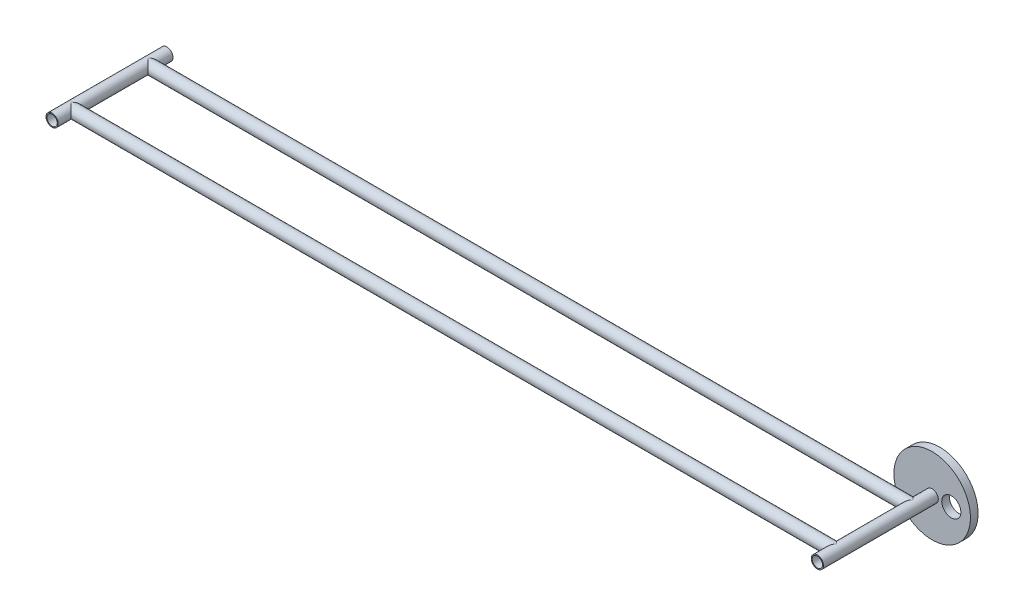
from build123d import *

# Parameters (mm, degrees)
SKETCH1_R                = 8
SKETCH1_R_2              = 6.75
BOSS_EXTRUDE1_DEPTH      = 1000
BOSS_EXTRUDE1_2_DEPTH    = 1000
BOSS_EXTRUDE2_DEPTH      = 75
BOSS_EXTRUDE2_DEPTH_BACK = 75
SKETCH2_R                = 8
SKETCH2_R_2              = 6.75
CUT_EXTRUDE1_START       = -150
SKETCH3_R                = 6.75
CUT_EXTRUDE1_DEPTH       = 150
BOSS_EXTRUDE3_DEPTH      = 75
BOSS_EXTRUDE3_DEPTH_BACK = 75
SKETCH4_R                = 8
SKETCH4_R_2              = 6.75
SKETCH6_R                = 6.75
CUT_EXTRUDE2_DEPTH       = 150
SKETCH7_R                = 50
SKETCH7_R_2              = 6.75
SKETCH7_R_3              = 12.5
BOSS_EXTRUDE4_DEPTH      = 10


with BuildPart() as part:
    # Sketch1 → Boss-Extrude1 (new body)
    with BuildSketch(Plane(origin=(0, 0, 0), x_dir=(0, 0, -1), z_dir=(1, 0, 0))):
        with Locations((-50, 0)):
            Circle(SKETCH1_R)
        with Locations((-50, 0)):
            Circle(SKETCH1_R_2, mode=Mode.SUBTRACT)
    extrude(amount=BOSS_EXTRUDE1_DEPTH)



with BuildPart() as body_2:
    # Sketch1 → Boss-Extrude1 2 (new body)
    with BuildSketch(Plane(origin=(0, 0, 0), x_dir=(0, 0, -1), z_dir=(1, 0, 0))):
        with Locations((50, 0)):
            Circle(SKETCH1_R)
        with Locations((50, 0)):
            Circle(SKETCH1_R_2, mode=Mode.SUBTRACT)
    extrude(amount=BOSS_EXTRUDE1_2_DEPTH)


with BuildPart() as part_1:
    add(part.part)

    add(body_2.part)  # Boss-Extrude2 merges body 2
    # Sketch2 → Boss-Extrude2 (add, two sides: drawn at the far end of the back side and taken through both)
    with BuildSketch(Plane.XY.offset(-BOSS_EXTRUDE2_DEPTH_BACK)):
        Circle(SKETCH2_R)
        Circle(SKETCH2_R_2, mode=Mode.SUBTRACT)
    extrude(amount=BOSS_EXTRUDE2_DEPTH + BOSS_EXTRUDE2_DEPTH_BACK)

    # Sketch3 → Cut-Extrude1 (cut)
    with BuildSketch(Plane.XY.offset(75).offset(CUT_EXTRUDE1_START)):
        Circle(SKETCH3_R)
    extrude(amount=CUT_EXTRUDE1_DEPTH, mode=Mode.SUBTRACT)

    # Sketch4 → Boss-Extrude3 (add, two sides: drawn at the far end of the back side and taken through both)
    with BuildSketch(Plane.XY.offset(-BOSS_EXTRUDE3_DEPTH_BACK)):
        with Locations((1000, 0)):
            Circle(SKETCH4_R)
        with Locations((1000, 0)):
            Circle(SKETCH4_R_2, mode=Mode.SUBTRACT)
    extrude(amount=BOSS_EXTRUDE3_DEPTH + BOSS_EXTRUDE3_DEPTH_BACK)

    # Sketch6 → Cut-Extrude2 (cut)
    with BuildSketch(Plane.XY.offset(75)):
        with Locations((1000, 0)):
            Circle(SKETCH6_R)
    extrude(amount=-CUT_EXTRUDE2_DEPTH, mode=Mode.SUBTRACT)

    # Sketch7 → Boss-Extrude4 (add)
    with BuildSketch(Plane(origin=(0, 0, -75), x_dir=(-1, 0, 0), z_dir=(0, 0, -1))):
        with Locations((-1000, 0)):
            Circle(SKETCH7_R)
        with Locations(Location((-1000, 0, 0), (0, 0, 180))):
            Circle(SKETCH7_R_2, mode=Mode.SUBTRACT)
        with Locations((-1025, 0)):
            Circle(SKETCH7_R_3, mode=Mode.SUBTRACT)
    extrude(amount=BOSS_EXTRUDE4_DEPTH)


solid = part_1.part
